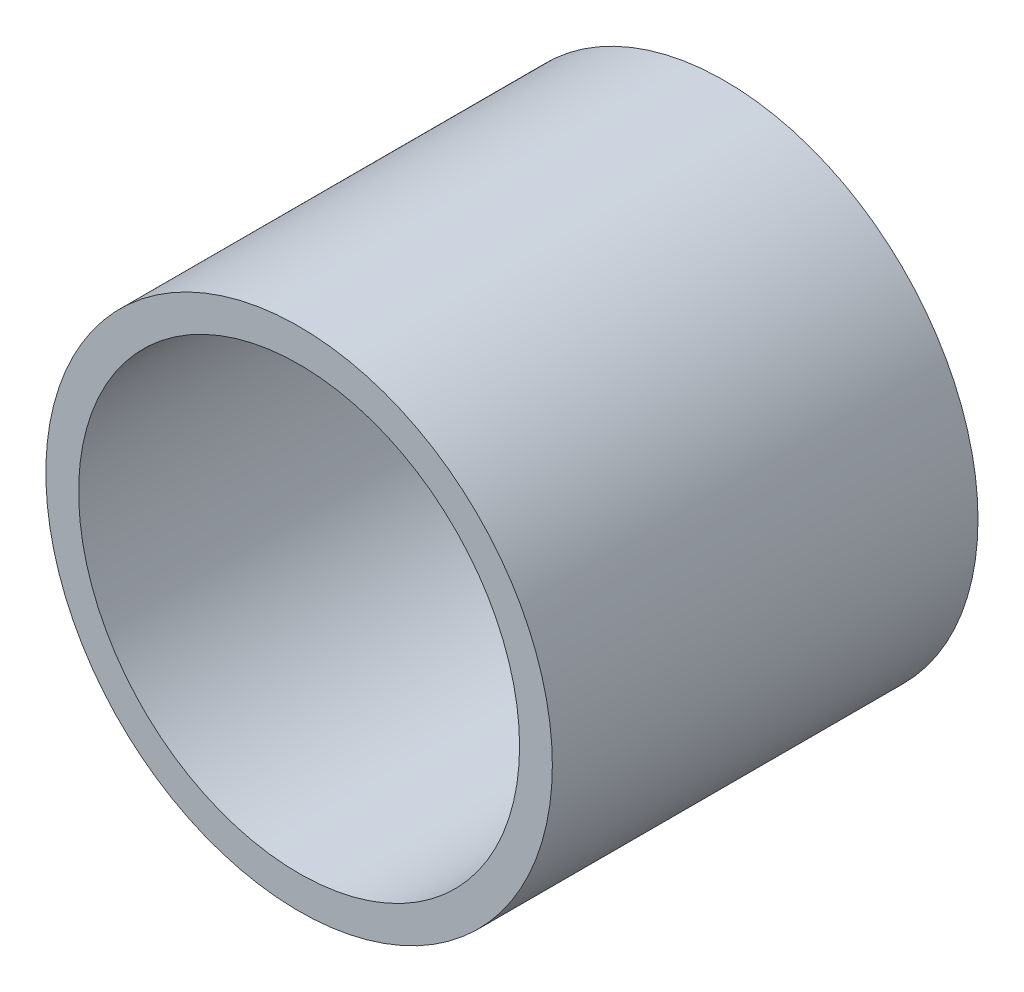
ISO-10303-21;
HEADER;
FILE_DESCRIPTION(('STEP AP214'),'2;1');
FILE_NAME('part.step','',(''),(''),'','','');
FILE_SCHEMA(('AUTOMOTIVE_DESIGN { 1 0 10303 214 1 1 1 1 }'));
ENDSEC;
DATA;
#1=APPLICATION_CONTEXT('core data for automotive mechanical design processes');
#2=APPLICATION_PROTOCOL_DEFINITION('international standard','automotive_design',2000,#1);
#3=PRODUCT_CONTEXT('',#1,'mechanical');
#4=PRODUCT('Part','Part','',(#3));
#5=PRODUCT_RELATED_PRODUCT_CATEGORY('part','',(#4));
#6=PRODUCT_DEFINITION_FORMATION('','',#4);
#7=PRODUCT_DEFINITION_CONTEXT('part definition',#1,'design');
#8=PRODUCT_DEFINITION('design','',#6,#7);
#9=PRODUCT_DEFINITION_SHAPE('','',#8);
#10=(LENGTH_UNIT() NAMED_UNIT(*) SI_UNIT(.MILLI.,.METRE.));
#11=(NAMED_UNIT(*) PLANE_ANGLE_UNIT() SI_UNIT($,.RADIAN.));
#12=(NAMED_UNIT(*) SI_UNIT($,.STERADIAN.) SOLID_ANGLE_UNIT());
#13=UNCERTAINTY_MEASURE_WITH_UNIT(LENGTH_MEASURE(1.E-05),#10,'distance_accuracy_value','');
#14=(GEOMETRIC_REPRESENTATION_CONTEXT(3) GLOBAL_UNCERTAINTY_ASSIGNED_CONTEXT((#13)) GLOBAL_UNIT_ASSIGNED_CONTEXT((#10,
#11,#12)) REPRESENTATION_CONTEXT('',''));
#15=CARTESIAN_POINT('',(0.,0.,0.));
#16=DIRECTION('',(0.,0.,1.));
#17=DIRECTION('',(1.,0.,0.));
#18=AXIS2_PLACEMENT_3D('',#15,#16,#17);
#19=CARTESIAN_POINT('',(0.,0.,50.8));
#20=DIRECTION('',(0.,0.,1.));
#21=DIRECTION('',(1.,0.,0.));
#22=AXIS2_PLACEMENT_3D('',#19,#20,#21);
#23=PLANE('',#22);
#24=CARTESIAN_POINT('',(0.,0.,50.8));
#25=DIRECTION('',(0.,0.,1.));
#26=DIRECTION('',(1.,0.,0.));
#27=AXIS2_PLACEMENT_3D('',#24,#25,#26);
#28=CIRCLE('',#27,30.226);
#29=CARTESIAN_POINT('',(30.226,0.,50.8));
#30=VERTEX_POINT('',#29);
#31=EDGE_CURVE('E10',#30,#30,#28,.T.);
#32=ORIENTED_EDGE('',*,*,#31,.T.);
#33=EDGE_LOOP('',(#32));
#34=FACE_BOUND('',#33,.T.);
#35=CARTESIAN_POINT('',(0.,0.,50.8));
#36=DIRECTION('',(0.,0.,1.));
#37=DIRECTION('',(1.,0.,0.));
#38=AXIS2_PLACEMENT_3D('',#35,#36,#37);
#39=CIRCLE('',#38,26.3144);
#40=CARTESIAN_POINT('',(26.3144,0.,50.8));
#41=VERTEX_POINT('',#40);
#42=EDGE_CURVE('E40',#41,#41,#39,.T.);
#43=ORIENTED_EDGE('',*,*,#42,.F.);
#44=EDGE_LOOP('',(#43));
#45=FACE_BOUND('',#44,.T.);
#46=ADVANCED_FACE('F29',(#34,#45),#23,.T.);
#47=CARTESIAN_POINT('',(0.,0.,0.));
#48=DIRECTION('',(0.,0.,1.));
#49=DIRECTION('',(1.,0.,0.));
#50=AXIS2_PLACEMENT_3D('',#47,#48,#49);
#51=PLANE('',#50);
#52=CARTESIAN_POINT('',(0.,0.,0.));
#53=DIRECTION('',(0.,0.,1.));
#54=DIRECTION('',(1.,0.,0.));
#55=AXIS2_PLACEMENT_3D('',#52,#53,#54);
#56=CIRCLE('',#55,30.226);
#57=CARTESIAN_POINT('',(30.226,0.,0.));
#58=VERTEX_POINT('',#57);
#59=EDGE_CURVE('E33',#58,#58,#56,.T.);
#60=ORIENTED_EDGE('',*,*,#59,.F.);
#61=EDGE_LOOP('',(#60));
#62=FACE_BOUND('',#61,.T.);
#63=CARTESIAN_POINT('',(0.,0.,0.));
#64=DIRECTION('',(0.,0.,1.));
#65=DIRECTION('',(1.,0.,0.));
#66=AXIS2_PLACEMENT_3D('',#63,#64,#65);
#67=CIRCLE('',#66,26.3144);
#68=CARTESIAN_POINT('',(26.3144,0.,0.));
#69=VERTEX_POINT('',#68);
#70=EDGE_CURVE('E42',#69,#69,#67,.T.);
#71=ORIENTED_EDGE('',*,*,#70,.T.);
#72=EDGE_LOOP('',(#71));
#73=FACE_BOUND('',#72,.T.);
#74=ADVANCED_FACE('F52',(#62,#73),#51,.F.);
#75=CARTESIAN_POINT('',(0.,0.,50.8));
#76=DIRECTION('',(0.,0.,-1.));
#77=DIRECTION('',(-1.,0.,0.));
#78=AXIS2_PLACEMENT_3D('',#75,#76,#77);
#79=CYLINDRICAL_SURFACE('',#78,30.226);
#80=ORIENTED_EDGE('',*,*,#31,.F.);
#81=EDGE_LOOP('',(#80));
#82=FACE_BOUND('',#81,.T.);
#83=ORIENTED_EDGE('',*,*,#59,.T.);
#84=EDGE_LOOP('',(#83));
#85=FACE_BOUND('',#84,.T.);
#86=ADVANCED_FACE('F31',(#82,#85),#79,.T.);
#87=CARTESIAN_POINT('',(0.,0.,50.8));
#88=DIRECTION('',(0.,0.,-1.));
#89=DIRECTION('',(-1.,0.,0.));
#90=AXIS2_PLACEMENT_3D('',#87,#88,#89);
#91=CYLINDRICAL_SURFACE('',#90,26.3144);
#92=ORIENTED_EDGE('',*,*,#42,.T.);
#93=EDGE_LOOP('',(#92));
#94=FACE_BOUND('',#93,.T.);
#95=ORIENTED_EDGE('',*,*,#70,.F.);
#96=EDGE_LOOP('',(#95));
#97=FACE_BOUND('',#96,.T.);
#98=ADVANCED_FACE('F48',(#94,#97),#91,.F.);
#99=CLOSED_SHELL('',(#46,#74,#86,#98));
#100=MANIFOLD_SOLID_BREP('B2',#99);
#101=ADVANCED_BREP_SHAPE_REPRESENTATION('',(#18,#100),#14);
#102=SHAPE_DEFINITION_REPRESENTATION(#9,#101);
ENDSEC;
END-ISO-10303-21;
